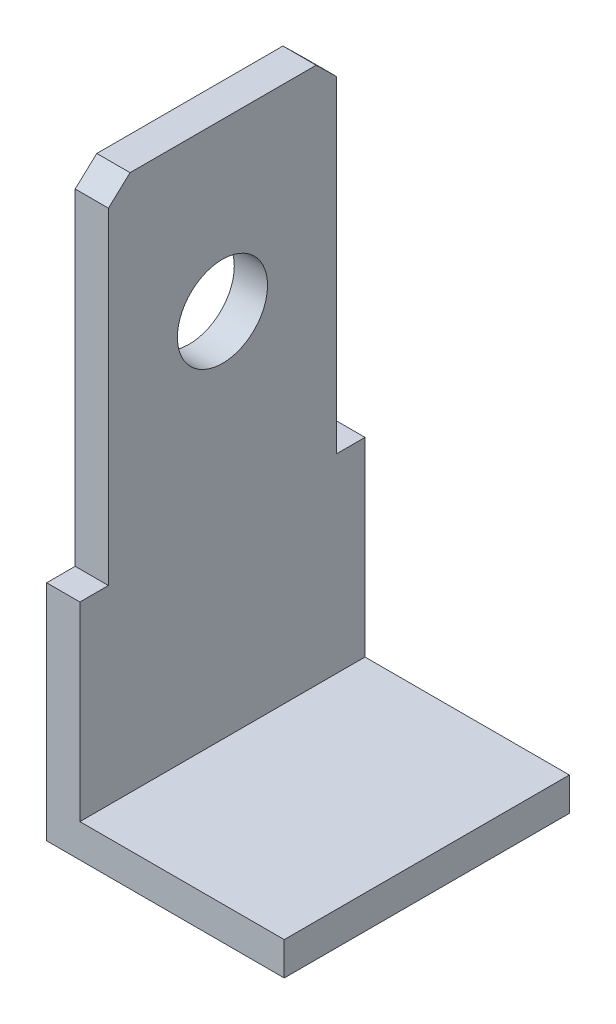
ISO-10303-21;
HEADER;
FILE_DESCRIPTION(('STEP AP214'),'2;1');
FILE_NAME('part.step','',(''),(''),'','','');
FILE_SCHEMA(('AUTOMOTIVE_DESIGN { 1 0 10303 214 1 1 1 1 }'));
ENDSEC;
DATA;
#1=APPLICATION_CONTEXT('core data for automotive mechanical design processes');
#2=APPLICATION_PROTOCOL_DEFINITION('international standard','automotive_design',2000,#1);
#3=PRODUCT_CONTEXT('',#1,'mechanical');
#4=PRODUCT('Part','Part','',(#3));
#5=PRODUCT_RELATED_PRODUCT_CATEGORY('part','',(#4));
#6=PRODUCT_DEFINITION_FORMATION('','',#4);
#7=PRODUCT_DEFINITION_CONTEXT('part definition',#1,'design');
#8=PRODUCT_DEFINITION('design','',#6,#7);
#9=PRODUCT_DEFINITION_SHAPE('','',#8);
#10=(LENGTH_UNIT() NAMED_UNIT(*) SI_UNIT(.MILLI.,.METRE.));
#11=(NAMED_UNIT(*) PLANE_ANGLE_UNIT() SI_UNIT($,.RADIAN.));
#12=(NAMED_UNIT(*) SI_UNIT($,.STERADIAN.) SOLID_ANGLE_UNIT());
#13=UNCERTAINTY_MEASURE_WITH_UNIT(LENGTH_MEASURE(1.E-05),#10,'distance_accuracy_value','');
#14=(GEOMETRIC_REPRESENTATION_CONTEXT(3) GLOBAL_UNCERTAINTY_ASSIGNED_CONTEXT((#13)) GLOBAL_UNIT_ASSIGNED_CONTEXT((#10,
#11,#12)) REPRESENTATION_CONTEXT('',''));
#15=CARTESIAN_POINT('',(0.,0.,0.));
#16=DIRECTION('',(0.,0.,1.));
#17=DIRECTION('',(1.,0.,0.));
#18=AXIS2_PLACEMENT_3D('',#15,#16,#17);
#19=CARTESIAN_POINT('',(5.,0.,6.));
#20=DIRECTION('',(0.,1.,0.));
#21=DIRECTION('',(-1.,0.,0.));
#22=AXIS2_PLACEMENT_3D('',#19,#20,#21);
#23=PLANE('',#22);
#24=DIRECTION('',(1.,0.,0.));
#25=VECTOR('',#24,1.);
#26=CARTESIAN_POINT('',(5.,0.,0.));
#27=LINE('',#26,#25);
#28=CARTESIAN_POINT('',(0.,0.,0.));
#29=VERTEX_POINT('',#28);
#30=CARTESIAN_POINT('',(5.,0.,0.));
#31=VERTEX_POINT('',#30);
#32=EDGE_CURVE('E166',#29,#31,#27,.T.);
#33=ORIENTED_EDGE('',*,*,#32,.T.);
#34=DIRECTION('',(0.,0.,-1.));
#35=VECTOR('',#34,1.);
#36=CARTESIAN_POINT('',(5.,0.,6.));
#37=LINE('',#36,#35);
#38=CARTESIAN_POINT('',(5.,0.,6.));
#39=VERTEX_POINT('',#38);
#40=EDGE_CURVE('E159',#39,#31,#37,.T.);
#41=ORIENTED_EDGE('',*,*,#40,.F.);
#42=DIRECTION('',(1.,0.,0.));
#43=VECTOR('',#42,1.);
#44=CARTESIAN_POINT('',(5.,0.,6.));
#45=LINE('',#44,#43);
#46=CARTESIAN_POINT('',(0.,0.,6.));
#47=VERTEX_POINT('',#46);
#48=EDGE_CURVE('E201',#47,#39,#45,.T.);
#49=ORIENTED_EDGE('',*,*,#48,.F.);
#50=DIRECTION('',(0.,0.,-1.));
#51=VECTOR('',#50,1.);
#52=CARTESIAN_POINT('',(0.,0.,6.));
#53=LINE('',#52,#51);
#54=EDGE_CURVE('E153',#47,#29,#53,.T.);
#55=ORIENTED_EDGE('',*,*,#54,.T.);
#56=EDGE_LOOP('',(#33,#41,#49,#55));
#57=FACE_BOUND('',#56,.T.);
#58=ADVANCED_FACE('F33',(#57),#23,.F.);
#59=CARTESIAN_POINT('',(5.,0.699999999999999,6.));
#60=DIRECTION('',(-1.,0.,0.));
#61=DIRECTION('',(0.,0.,1.));
#62=AXIS2_PLACEMENT_3D('',#59,#60,#61);
#63=PLANE('',#62);
#64=DIRECTION('',(0.,1.,0.));
#65=VECTOR('',#64,1.);
#66=CARTESIAN_POINT('',(5.,0.699999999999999,0.));
#67=LINE('',#66,#65);
#68=CARTESIAN_POINT('',(5.,0.699999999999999,0.));
#69=VERTEX_POINT('',#68);
#70=EDGE_CURVE('E216',#31,#69,#67,.T.);
#71=ORIENTED_EDGE('',*,*,#70,.T.);
#72=DIRECTION('',(0.,0.,-1.));
#73=VECTOR('',#72,1.);
#74=CARTESIAN_POINT('',(5.,0.699999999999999,6.));
#75=LINE('',#74,#73);
#76=CARTESIAN_POINT('',(5.,0.699999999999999,6.));
#77=VERTEX_POINT('',#76);
#78=EDGE_CURVE('E151',#77,#69,#75,.T.);
#79=ORIENTED_EDGE('',*,*,#78,.F.);
#80=DIRECTION('',(0.,1.,0.));
#81=VECTOR('',#80,1.);
#82=CARTESIAN_POINT('',(5.,0.699999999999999,6.));
#83=LINE('',#82,#81);
#84=EDGE_CURVE('E204',#39,#77,#83,.T.);
#85=ORIENTED_EDGE('',*,*,#84,.F.);
#86=ORIENTED_EDGE('',*,*,#40,.T.);
#87=EDGE_LOOP('',(#71,#79,#85,#86));
#88=FACE_BOUND('',#87,.T.);
#89=ADVANCED_FACE('F236',(#88),#63,.F.);
#90=CARTESIAN_POINT('',(0.700000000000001,0.699999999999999,6.));
#91=DIRECTION('',(0.,-1.,0.));
#92=DIRECTION('',(1.,0.,0.));
#93=AXIS2_PLACEMENT_3D('',#90,#91,#92);
#94=PLANE('',#93);
#95=DIRECTION('',(-1.,0.,0.));
#96=VECTOR('',#95,1.);
#97=CARTESIAN_POINT('',(0.700000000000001,0.699999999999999,0.));
#98=LINE('',#97,#96);
#99=CARTESIAN_POINT('',(0.700000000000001,0.699999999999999,0.));
#100=VERTEX_POINT('',#99);
#101=EDGE_CURVE('E218',#69,#100,#98,.T.);
#102=ORIENTED_EDGE('',*,*,#101,.T.);
#103=DIRECTION('',(0.,0.,-1.));
#104=VECTOR('',#103,1.);
#105=CARTESIAN_POINT('',(0.700000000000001,0.699999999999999,6.));
#106=LINE('',#105,#104);
#107=CARTESIAN_POINT('',(0.700000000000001,0.699999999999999,6.));
#108=VERTEX_POINT('',#107);
#109=EDGE_CURVE('E147',#108,#100,#106,.T.);
#110=ORIENTED_EDGE('',*,*,#109,.F.);
#111=DIRECTION('',(-1.,0.,0.));
#112=VECTOR('',#111,1.);
#113=CARTESIAN_POINT('',(0.700000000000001,0.699999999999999,6.));
#114=LINE('',#113,#112);
#115=EDGE_CURVE('E207',#77,#108,#114,.T.);
#116=ORIENTED_EDGE('',*,*,#115,.F.);
#117=ORIENTED_EDGE('',*,*,#78,.T.);
#118=EDGE_LOOP('',(#102,#110,#116,#117));
#119=FACE_BOUND('',#118,.T.);
#120=ADVANCED_FACE('F268',(#119),#94,.F.);
#121=CARTESIAN_POINT('',(0.7,12.,6.));
#122=DIRECTION('',(-1.,0.,0.));
#123=DIRECTION('',(0.,-1.,0.));
#124=AXIS2_PLACEMENT_3D('',#121,#122,#123);
#125=PLANE('',#124);
#126=CARTESIAN_POINT('',(0.7,8.5,3.));
#127=DIRECTION('',(1.,0.,0.));
#128=DIRECTION('',(0.,1.,0.));
#129=AXIS2_PLACEMENT_3D('',#126,#127,#128);
#130=CIRCLE('',#129,0.948914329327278);
#131=CARTESIAN_POINT('',(0.7,9.44891432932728,3.));
#132=VERTEX_POINT('',#131);
#133=EDGE_CURVE('E167',#132,#132,#130,.T.);
#134=ORIENTED_EDGE('',*,*,#133,.F.);
#135=EDGE_LOOP('',(#134));
#136=FACE_BOUND('',#135,.T.);
#137=DIRECTION('',(0.,1.,0.));
#138=VECTOR('',#137,1.);
#139=CARTESIAN_POINT('',(0.7,12.,0.));
#140=LINE('',#139,#138);
#141=CARTESIAN_POINT('',(0.7,4.70327222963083,0.));
#142=VERTEX_POINT('',#141);
#143=EDGE_CURVE('E220',#100,#142,#140,.T.);
#144=ORIENTED_EDGE('',*,*,#143,.T.);
#145=DIRECTION('',(0.,0.,-1.));
#146=VECTOR('',#145,1.);
#147=CARTESIAN_POINT('',(0.700000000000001,4.70327222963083,0.6));
#148=LINE('',#147,#146);
#149=CARTESIAN_POINT('',(0.700000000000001,4.70327222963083,0.6));
#150=VERTEX_POINT('',#149);
#151=EDGE_CURVE('E55',#150,#142,#148,.T.);
#152=ORIENTED_EDGE('',*,*,#151,.F.);
#153=DIRECTION('',(0.,-1.,0.));
#154=VECTOR('',#153,1.);
#155=CARTESIAN_POINT('',(0.7,11.5804631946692,0.600000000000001));
#156=LINE('',#155,#154);
#157=CARTESIAN_POINT('',(0.7,11.5804631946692,0.600000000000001));
#158=VERTEX_POINT('',#157);
#159=EDGE_CURVE('E134',#158,#150,#156,.T.);
#160=ORIENTED_EDGE('',*,*,#159,.F.);
#161=DIRECTION('',(0.,-0.699984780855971,-0.714157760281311));
#162=VECTOR('',#161,1.);
#163=CARTESIAN_POINT('',(0.7,12.,1.0280313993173));
#164=LINE('',#163,#162);
#165=CARTESIAN_POINT('',(0.7,12.,1.0280313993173));
#166=VERTEX_POINT('',#165);
#167=EDGE_CURVE('E126',#166,#158,#164,.T.);
#168=ORIENTED_EDGE('',*,*,#167,.F.);
#169=DIRECTION('',(0.,0.,-1.));
#170=VECTOR('',#169,1.);
#171=CARTESIAN_POINT('',(0.7,12.,6.));
#172=LINE('',#171,#170);
#173=CARTESIAN_POINT('',(0.7,12.,4.94453337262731));
#174=VERTEX_POINT('',#173);
#175=EDGE_CURVE('E141',#174,#166,#172,.T.);
#176=ORIENTED_EDGE('',*,*,#175,.F.);
#177=DIRECTION('',(0.,0.677500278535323,-0.735522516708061));
#178=VECTOR('',#177,1.);
#179=CARTESIAN_POINT('',(0.7,11.5804631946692,5.4));
#180=LINE('',#179,#178);
#181=CARTESIAN_POINT('',(0.7,11.5804631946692,5.4));
#182=VERTEX_POINT('',#181);
#183=EDGE_CURVE('E191',#182,#174,#180,.T.);
#184=ORIENTED_EDGE('',*,*,#183,.F.);
#185=DIRECTION('',(0.,1.,0.));
#186=VECTOR('',#185,1.);
#187=CARTESIAN_POINT('',(0.7,11.5804631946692,5.4));
#188=LINE('',#187,#186);
#189=CARTESIAN_POINT('',(0.700000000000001,4.70327222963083,5.4));
#190=VERTEX_POINT('',#189);
#191=EDGE_CURVE('E187',#190,#182,#188,.T.);
#192=ORIENTED_EDGE('',*,*,#191,.F.);
#193=DIRECTION('',(0.,0.,-1.));
#194=VECTOR('',#193,1.);
#195=CARTESIAN_POINT('',(0.700000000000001,4.70327222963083,5.4));
#196=LINE('',#195,#194);
#197=CARTESIAN_POINT('',(0.700000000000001,4.70327222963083,6.));
#198=VERTEX_POINT('',#197);
#199=EDGE_CURVE('E244',#198,#190,#196,.T.);
#200=ORIENTED_EDGE('',*,*,#199,.F.);
#201=DIRECTION('',(0.,1.,0.));
#202=VECTOR('',#201,1.);
#203=CARTESIAN_POINT('',(0.7,12.,6.));
#204=LINE('',#203,#202);
#205=EDGE_CURVE('E209',#108,#198,#204,.T.);
#206=ORIENTED_EDGE('',*,*,#205,.F.);
#207=ORIENTED_EDGE('',*,*,#109,.T.);
#208=EDGE_LOOP('',(#144,#152,#160,#168,#176,#184,#192,#200,#206,#207));
#209=FACE_BOUND('',#208,.T.);
#210=ADVANCED_FACE('F139',(#136,#209),#125,.F.);
#211=CARTESIAN_POINT('',(0.,12.,6.));
#212=DIRECTION('',(0.,-1.,0.));
#213=DIRECTION('',(0.,0.,-1.));
#214=AXIS2_PLACEMENT_3D('',#211,#212,#213);
#215=PLANE('',#214);
#216=ORIENTED_EDGE('',*,*,#175,.T.);
#217=DIRECTION('',(1.,0.,0.));
#218=VECTOR('',#217,1.);
#219=CARTESIAN_POINT('',(-0.3,12.,1.0280313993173));
#220=LINE('',#219,#218);
#221=CARTESIAN_POINT('',(0.,12.,1.0280313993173));
#222=VERTEX_POINT('',#221);
#223=EDGE_CURVE('E122',#222,#166,#220,.T.);
#224=ORIENTED_EDGE('',*,*,#223,.F.);
#225=DIRECTION('',(0.,0.,-1.));
#226=VECTOR('',#225,1.);
#227=CARTESIAN_POINT('',(0.,12.,6.));
#228=LINE('',#227,#226);
#229=CARTESIAN_POINT('',(0.,12.,4.94453337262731));
#230=VERTEX_POINT('',#229);
#231=EDGE_CURVE('E148',#230,#222,#228,.T.);
#232=ORIENTED_EDGE('',*,*,#231,.F.);
#233=DIRECTION('',(1.,0.,0.));
#234=VECTOR('',#233,1.);
#235=CARTESIAN_POINT('',(-0.3,12.,4.94453337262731));
#236=LINE('',#235,#234);
#237=EDGE_CURVE('E146',#230,#174,#236,.T.);
#238=ORIENTED_EDGE('',*,*,#237,.T.);
#239=EDGE_LOOP('',(#216,#224,#232,#238));
#240=FACE_BOUND('',#239,.T.);
#241=ADVANCED_FACE('F145',(#240),#215,.F.);
#242=CARTESIAN_POINT('',(0.,0.,6.));
#243=DIRECTION('',(1.,0.,0.));
#244=DIRECTION('',(0.,0.,-1.));
#245=AXIS2_PLACEMENT_3D('',#242,#243,#244);
#246=PLANE('',#245);
#247=CARTESIAN_POINT('',(0.,8.5,3.));
#248=DIRECTION('',(1.,0.,0.));
#249=DIRECTION('',(0.,0.,-1.));
#250=AXIS2_PLACEMENT_3D('',#247,#248,#249);
#251=CIRCLE('',#250,0.948914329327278);
#252=CARTESIAN_POINT('',(0.,8.5,2.05108567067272));
#253=VERTEX_POINT('',#252);
#254=EDGE_CURVE('E163',#253,#253,#251,.T.);
#255=ORIENTED_EDGE('',*,*,#254,.T.);
#256=EDGE_LOOP('',(#255));
#257=FACE_BOUND('',#256,.T.);
#258=DIRECTION('',(0.,-1.,0.));
#259=VECTOR('',#258,1.);
#260=CARTESIAN_POINT('',(0.,0.,0.599999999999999));
#261=LINE('',#260,#259);
#262=CARTESIAN_POINT('',(0.,11.5804631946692,0.600000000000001));
#263=VERTEX_POINT('',#262);
#264=CARTESIAN_POINT('',(0.,4.70327222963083,0.6));
#265=VERTEX_POINT('',#264);
#266=EDGE_CURVE('E11',#263,#265,#261,.T.);
#267=ORIENTED_EDGE('',*,*,#266,.T.);
#268=DIRECTION('',(0.,0.,-1.));
#269=VECTOR('',#268,1.);
#270=CARTESIAN_POINT('',(0.,4.70327222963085,5.99999999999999));
#271=LINE('',#270,#269);
#272=CARTESIAN_POINT('',(0.,4.70327222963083,0.));
#273=VERTEX_POINT('',#272);
#274=EDGE_CURVE('E195',#265,#273,#271,.T.);
#275=ORIENTED_EDGE('',*,*,#274,.T.);
#276=DIRECTION('',(0.,-1.,0.));
#277=VECTOR('',#276,1.);
#278=CARTESIAN_POINT('',(0.,0.,0.));
#279=LINE('',#278,#277);
#280=EDGE_CURVE('E205',#273,#29,#279,.T.);
#281=ORIENTED_EDGE('',*,*,#280,.T.);
#282=ORIENTED_EDGE('',*,*,#54,.F.);
#283=DIRECTION('',(0.,-1.,0.));
#284=VECTOR('',#283,1.);
#285=CARTESIAN_POINT('',(0.,0.,6.));
#286=LINE('',#285,#284);
#287=CARTESIAN_POINT('',(0.,4.70327222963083,6.));
#288=VERTEX_POINT('',#287);
#289=EDGE_CURVE('E212',#288,#47,#286,.T.);
#290=ORIENTED_EDGE('',*,*,#289,.F.);
#291=DIRECTION('',(0.,0.,-1.));
#292=VECTOR('',#291,1.);
#293=CARTESIAN_POINT('',(0.,4.70327222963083,6.));
#294=LINE('',#293,#292);
#295=CARTESIAN_POINT('',(0.,4.70327222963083,5.4));
#296=VERTEX_POINT('',#295);
#297=EDGE_CURVE('E47',#288,#296,#294,.T.);
#298=ORIENTED_EDGE('',*,*,#297,.T.);
#299=DIRECTION('',(0.,1.,0.));
#300=VECTOR('',#299,1.);
#301=CARTESIAN_POINT('',(0.,0.,5.4));
#302=LINE('',#301,#300);
#303=CARTESIAN_POINT('',(0.,11.5804631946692,5.4));
#304=VERTEX_POINT('',#303);
#305=EDGE_CURVE('E171',#296,#304,#302,.T.);
#306=ORIENTED_EDGE('',*,*,#305,.T.);
#307=DIRECTION('',(0.,0.677500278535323,-0.735522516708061));
#308=VECTOR('',#307,1.);
#309=CARTESIAN_POINT('',(0.,5.96596381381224,11.4953343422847));
#310=LINE('',#309,#308);
#311=EDGE_CURVE('E174',#304,#230,#310,.T.);
#312=ORIENTED_EDGE('',*,*,#311,.T.);
#313=ORIENTED_EDGE('',*,*,#231,.T.);
#314=DIRECTION('',(0.,-0.699984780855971,-0.714157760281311));
#315=VECTOR('',#314,1.);
#316=CARTESIAN_POINT('',(0.,8.60574061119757,-2.43495343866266));
#317=LINE('',#316,#315);
#318=EDGE_CURVE('E40',#222,#263,#317,.T.);
#319=ORIENTED_EDGE('',*,*,#318,.T.);
#320=EDGE_LOOP('',(#267,#275,#281,#282,#290,#298,#306,#312,#313,#319));
#321=FACE_BOUND('',#320,.T.);
#322=ADVANCED_FACE('F177',(#257,#321),#246,.F.);
#323=CARTESIAN_POINT('',(0.,0.,6.));
#324=DIRECTION('',(0.,0.,-1.));
#325=DIRECTION('',(-1.,0.,0.));
#326=AXIS2_PLACEMENT_3D('',#323,#324,#325);
#327=PLANE('',#326);
#328=ORIENTED_EDGE('',*,*,#205,.T.);
#329=DIRECTION('',(-1.,0.,0.));
#330=VECTOR('',#329,1.);
#331=CARTESIAN_POINT('',(0.,4.70327222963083,6.));
#332=LINE('',#331,#330);
#333=EDGE_CURVE('E169',#198,#288,#332,.T.);
#334=ORIENTED_EDGE('',*,*,#333,.T.);
#335=ORIENTED_EDGE('',*,*,#289,.T.);
#336=ORIENTED_EDGE('',*,*,#48,.T.);
#337=ORIENTED_EDGE('',*,*,#84,.T.);
#338=ORIENTED_EDGE('',*,*,#115,.T.);
#339=EDGE_LOOP('',(#328,#334,#335,#336,#337,#338));
#340=FACE_BOUND('',#339,.T.);
#341=ADVANCED_FACE('F239',(#340),#327,.F.);
#342=CARTESIAN_POINT('',(0.,0.,0.));
#343=DIRECTION('',(0.,0.,-1.));
#344=DIRECTION('',(-1.,0.,0.));
#345=AXIS2_PLACEMENT_3D('',#342,#343,#344);
#346=PLANE('',#345);
#347=DIRECTION('',(-1.,0.,0.));
#348=VECTOR('',#347,1.);
#349=CARTESIAN_POINT('',(0.,4.70327222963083,0.));
#350=LINE('',#349,#348);
#351=EDGE_CURVE('E162',#142,#273,#350,.T.);
#352=ORIENTED_EDGE('',*,*,#351,.F.);
#353=ORIENTED_EDGE('',*,*,#143,.F.);
#354=ORIENTED_EDGE('',*,*,#101,.F.);
#355=ORIENTED_EDGE('',*,*,#70,.F.);
#356=ORIENTED_EDGE('',*,*,#32,.F.);
#357=ORIENTED_EDGE('',*,*,#280,.F.);
#358=EDGE_LOOP('',(#352,#353,#354,#355,#356,#357));
#359=FACE_BOUND('',#358,.T.);
#360=ADVANCED_FACE('F231',(#359),#346,.T.);
#361=CARTESIAN_POINT('',(-0.3,8.5,3.));
#362=DIRECTION('',(1.,0.,0.));
#363=DIRECTION('',(0.,1.,0.));
#364=AXIS2_PLACEMENT_3D('',#361,#362,#363);
#365=CYLINDRICAL_SURFACE('',#364,0.948914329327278);
#366=ORIENTED_EDGE('',*,*,#133,.T.);
#367=EDGE_LOOP('',(#366));
#368=FACE_BOUND('',#367,.T.);
#369=ORIENTED_EDGE('',*,*,#254,.F.);
#370=EDGE_LOOP('',(#369));
#371=FACE_BOUND('',#370,.T.);
#372=ADVANCED_FACE('F285',(#368,#371),#365,.F.);
#373=CARTESIAN_POINT('',(-0.3,11.5804631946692,0.600000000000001));
#374=DIRECTION('',(0.,0.,1.));
#375=DIRECTION('',(0.,-1.,0.));
#376=AXIS2_PLACEMENT_3D('',#373,#374,#375);
#377=PLANE('',#376);
#378=DIRECTION('',(1.,0.,0.));
#379=VECTOR('',#378,1.);
#380=CARTESIAN_POINT('',(-0.3,11.5804631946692,0.600000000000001));
#381=LINE('',#380,#379);
#382=EDGE_CURVE('E133',#263,#158,#381,.T.);
#383=ORIENTED_EDGE('',*,*,#382,.T.);
#384=ORIENTED_EDGE('',*,*,#159,.T.);
#385=DIRECTION('',(1.,0.,0.));
#386=VECTOR('',#385,1.);
#387=CARTESIAN_POINT('',(-0.299999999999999,4.70327222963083,0.6));
#388=LINE('',#387,#386);
#389=EDGE_CURVE('E197',#265,#150,#388,.T.);
#390=ORIENTED_EDGE('',*,*,#389,.F.);
#391=ORIENTED_EDGE('',*,*,#266,.F.);
#392=EDGE_LOOP('',(#383,#384,#390,#391));
#393=FACE_BOUND('',#392,.T.);
#394=ADVANCED_FACE('F253',(#393),#377,.F.);
#395=CARTESIAN_POINT('',(-0.3,12.,1.0280313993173));
#396=DIRECTION('',(0.,-0.714157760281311,0.699984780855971));
#397=DIRECTION('',(0.,-0.699984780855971,-0.714157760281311));
#398=AXIS2_PLACEMENT_3D('',#395,#396,#397);
#399=PLANE('',#398);
#400=ORIENTED_EDGE('',*,*,#223,.T.);
#401=ORIENTED_EDGE('',*,*,#167,.T.);
#402=ORIENTED_EDGE('',*,*,#382,.F.);
#403=ORIENTED_EDGE('',*,*,#318,.F.);
#404=EDGE_LOOP('',(#400,#401,#402,#403));
#405=FACE_BOUND('',#404,.T.);
#406=ADVANCED_FACE('F124',(#405),#399,.F.);
#407=CARTESIAN_POINT('',(-0.299999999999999,4.70327222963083,0.6));
#408=DIRECTION('',(0.,-1.,0.));
#409=DIRECTION('',(0.,0.,-1.));
#410=AXIS2_PLACEMENT_3D('',#407,#408,#409);
#411=PLANE('',#410);
#412=ORIENTED_EDGE('',*,*,#389,.T.);
#413=ORIENTED_EDGE('',*,*,#151,.T.);
#414=ORIENTED_EDGE('',*,*,#351,.T.);
#415=ORIENTED_EDGE('',*,*,#274,.F.);
#416=EDGE_LOOP('',(#412,#413,#414,#415));
#417=FACE_BOUND('',#416,.T.);
#418=ADVANCED_FACE('F255',(#417),#411,.F.);
#419=CARTESIAN_POINT('',(-0.3,11.5804631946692,5.4));
#420=DIRECTION('',(0.,-0.735522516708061,-0.677500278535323));
#421=DIRECTION('',(0.,0.677500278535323,-0.735522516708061));
#422=AXIS2_PLACEMENT_3D('',#419,#420,#421);
#423=PLANE('',#422);
#424=DIRECTION('',(1.,0.,0.));
#425=VECTOR('',#424,1.);
#426=CARTESIAN_POINT('',(-0.3,11.5804631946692,5.4));
#427=LINE('',#426,#425);
#428=EDGE_CURVE('E182',#304,#182,#427,.T.);
#429=ORIENTED_EDGE('',*,*,#428,.T.);
#430=ORIENTED_EDGE('',*,*,#183,.T.);
#431=ORIENTED_EDGE('',*,*,#237,.F.);
#432=ORIENTED_EDGE('',*,*,#311,.F.);
#433=EDGE_LOOP('',(#429,#430,#431,#432));
#434=FACE_BOUND('',#433,.T.);
#435=ADVANCED_FACE('F181',(#434),#423,.F.);
#436=CARTESIAN_POINT('',(-0.3,11.5804631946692,5.4));
#437=DIRECTION('',(0.,0.,-1.));
#438=DIRECTION('',(0.,1.,0.));
#439=AXIS2_PLACEMENT_3D('',#436,#437,#438);
#440=PLANE('',#439);
#441=DIRECTION('',(1.,0.,0.));
#442=VECTOR('',#441,1.);
#443=CARTESIAN_POINT('',(-0.299999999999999,4.70327222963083,5.4));
#444=LINE('',#443,#442);
#445=EDGE_CURVE('E188',#296,#190,#444,.T.);
#446=ORIENTED_EDGE('',*,*,#445,.T.);
#447=ORIENTED_EDGE('',*,*,#191,.T.);
#448=ORIENTED_EDGE('',*,*,#428,.F.);
#449=ORIENTED_EDGE('',*,*,#305,.F.);
#450=EDGE_LOOP('',(#446,#447,#448,#449));
#451=FACE_BOUND('',#450,.T.);
#452=ADVANCED_FACE('F185',(#451),#440,.F.);
#453=CARTESIAN_POINT('',(-0.299999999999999,4.70327222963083,5.4));
#454=DIRECTION('',(0.,-1.,0.));
#455=DIRECTION('',(1.,0.,0.));
#456=AXIS2_PLACEMENT_3D('',#453,#454,#455);
#457=PLANE('',#456);
#458=ORIENTED_EDGE('',*,*,#333,.F.);
#459=ORIENTED_EDGE('',*,*,#199,.T.);
#460=ORIENTED_EDGE('',*,*,#445,.F.);
#461=ORIENTED_EDGE('',*,*,#297,.F.);
#462=EDGE_LOOP('',(#458,#459,#460,#461));
#463=FACE_BOUND('',#462,.T.);
#464=ADVANCED_FACE('F243',(#463),#457,.F.);
#465=CLOSED_SHELL('',(#58,#89,#120,#210,#241,#322,#341,#360,#372,#394,#406,#418,#435,#452,#464));
#466=MANIFOLD_SOLID_BREP('B2',#465);
#467=ADVANCED_BREP_SHAPE_REPRESENTATION('',(#18,#466),#14);
#468=SHAPE_DEFINITION_REPRESENTATION(#9,#467);
ENDSEC;
END-ISO-10303-21;
